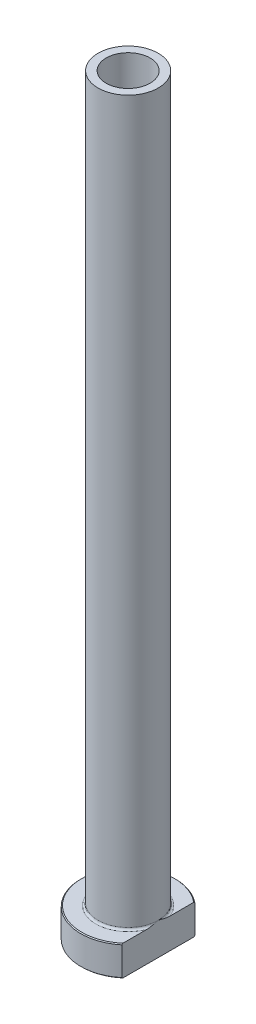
ISO-10303-21;
HEADER;
FILE_DESCRIPTION(('STEP AP214'),'2;1');
FILE_NAME('part.step','',(''),(''),'','','');
FILE_SCHEMA(('AUTOMOTIVE_DESIGN { 1 0 10303 214 1 1 1 1 }'));
ENDSEC;
DATA;
#1=APPLICATION_CONTEXT('core data for automotive mechanical design processes');
#2=APPLICATION_PROTOCOL_DEFINITION('international standard','automotive_design',2000,#1);
#3=PRODUCT_CONTEXT('',#1,'mechanical');
#4=PRODUCT('Part','Part','',(#3));
#5=PRODUCT_RELATED_PRODUCT_CATEGORY('part','',(#4));
#6=PRODUCT_DEFINITION_FORMATION('','',#4);
#7=PRODUCT_DEFINITION_CONTEXT('part definition',#1,'design');
#8=PRODUCT_DEFINITION('design','',#6,#7);
#9=PRODUCT_DEFINITION_SHAPE('','',#8);
#10=(LENGTH_UNIT() NAMED_UNIT(*) SI_UNIT(.MILLI.,.METRE.));
#11=(NAMED_UNIT(*) PLANE_ANGLE_UNIT() SI_UNIT($,.RADIAN.));
#12=(NAMED_UNIT(*) SI_UNIT($,.STERADIAN.) SOLID_ANGLE_UNIT());
#13=UNCERTAINTY_MEASURE_WITH_UNIT(LENGTH_MEASURE(1.E-05),#10,'distance_accuracy_value','');
#14=(GEOMETRIC_REPRESENTATION_CONTEXT(3) GLOBAL_UNCERTAINTY_ASSIGNED_CONTEXT((#13)) GLOBAL_UNIT_ASSIGNED_CONTEXT((#10,
#11,#12)) REPRESENTATION_CONTEXT('',''));
#15=CARTESIAN_POINT('',(0.,0.,0.));
#16=DIRECTION('',(0.,0.,1.));
#17=DIRECTION('',(1.,0.,0.));
#18=AXIS2_PLACEMENT_3D('',#15,#16,#17);
#19=CARTESIAN_POINT('',(0.,92.1876809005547,0.));
#20=DIRECTION('',(0.,1.,0.));
#21=DIRECTION('',(0.,0.,1.));
#22=AXIS2_PLACEMENT_3D('',#19,#20,#21);
#23=CYLINDRICAL_SURFACE('',#22,5.1);
#24=CARTESIAN_POINT('',(0.,175.,0.));
#25=DIRECTION('',(0.,1.,0.));
#26=DIRECTION('',(0.,0.,1.));
#27=AXIS2_PLACEMENT_3D('',#24,#25,#26);
#28=CIRCLE('',#27,5.1);
#29=CARTESIAN_POINT('',(0.,175.,5.1));
#30=VERTEX_POINT('',#29);
#31=EDGE_CURVE('E167',#30,#30,#28,.T.);
#32=ORIENTED_EDGE('',*,*,#31,.T.);
#33=EDGE_LOOP('',(#32));
#34=FACE_BOUND('',#33,.T.);
#35=CARTESIAN_POINT('',(0.,120.,0.));
#36=DIRECTION('',(0.,1.,0.));
#37=DIRECTION('',(0.,0.,1.));
#38=AXIS2_PLACEMENT_3D('',#35,#36,#37);
#39=CIRCLE('',#38,5.1);
#40=CARTESIAN_POINT('',(0.,120.,5.1));
#41=VERTEX_POINT('',#40);
#42=EDGE_CURVE('E170',#41,#41,#39,.T.);
#43=ORIENTED_EDGE('',*,*,#42,.F.);
#44=EDGE_LOOP('',(#43));
#45=FACE_BOUND('',#44,.T.);
#46=ADVANCED_FACE('F32',(#34,#45),#23,.F.);
#47=CARTESIAN_POINT('',(-5.1,175.,0.));
#48=DIRECTION('',(0.,1.,0.));
#49=DIRECTION('',(0.,0.,1.));
#50=AXIS2_PLACEMENT_3D('',#47,#48,#49);
#51=PLANE('',#50);
#52=CARTESIAN_POINT('',(0.,175.,0.));
#53=DIRECTION('',(0.,1.,0.));
#54=DIRECTION('',(0.,0.,1.));
#55=AXIS2_PLACEMENT_3D('',#52,#53,#54);
#56=CIRCLE('',#55,7.00000000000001);
#57=CARTESIAN_POINT('',(0.,175.,7.00000000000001));
#58=VERTEX_POINT('',#57);
#59=EDGE_CURVE('E174',#58,#58,#56,.T.);
#60=ORIENTED_EDGE('',*,*,#59,.T.);
#61=EDGE_LOOP('',(#60));
#62=FACE_BOUND('',#61,.T.);
#63=ORIENTED_EDGE('',*,*,#31,.F.);
#64=EDGE_LOOP('',(#63));
#65=FACE_BOUND('',#64,.T.);
#66=ADVANCED_FACE('F157',(#62,#65),#51,.T.);
#67=CARTESIAN_POINT('',(0.,92.1876809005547,0.));
#68=DIRECTION('',(0.,1.,0.));
#69=DIRECTION('',(0.,0.,1.));
#70=AXIS2_PLACEMENT_3D('',#67,#68,#69);
#71=CYLINDRICAL_SURFACE('',#70,7.);
#72=CARTESIAN_POINT('',(0.,7.50000000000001,0.));
#73=DIRECTION('',(0.,1.,0.));
#74=DIRECTION('',(0.,0.,1.));
#75=AXIS2_PLACEMENT_3D('',#72,#73,#74);
#76=CIRCLE('',#75,7.);
#77=CARTESIAN_POINT('',(7.,7.50000000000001,0.));
#78=VERTEX_POINT('',#77);
#79=EDGE_CURVE('E180',#78,#78,#76,.T.);
#80=ORIENTED_EDGE('',*,*,#79,.T.);
#81=EDGE_LOOP('',(#80));
#82=FACE_BOUND('',#81,.T.);
#83=ORIENTED_EDGE('',*,*,#59,.F.);
#84=EDGE_LOOP('',(#83));
#85=FACE_BOUND('',#84,.T.);
#86=ADVANCED_FACE('F162',(#82,#85),#71,.T.);
#87=CARTESIAN_POINT('',(-6.99999999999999,7.,0.));
#88=DIRECTION('',(0.,1.,0.));
#89=DIRECTION('',(0.,0.,1.));
#90=AXIS2_PLACEMENT_3D('',#87,#88,#89);
#91=PLANE('',#90);
#92=DIRECTION('',(0.,0.,1.));
#93=VECTOR('',#92,1.);
#94=CARTESIAN_POINT('',(6.99999999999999,7.,0.));
#95=LINE('',#94,#93);
#96=CARTESIAN_POINT('',(7.,7.,-8.22435407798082));
#97=VERTEX_POINT('',#96);
#98=CARTESIAN_POINT('',(6.99999999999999,7.,-2.69258240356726));
#99=VERTEX_POINT('',#98);
#100=EDGE_CURVE('E54',#97,#99,#95,.T.);
#101=ORIENTED_EDGE('',*,*,#100,.F.);
#102=CARTESIAN_POINT('',(0.,7.,0.));
#103=DIRECTION('',(0.,1.,0.));
#104=DIRECTION('',(0.,0.,1.));
#105=AXIS2_PLACEMENT_3D('',#102,#103,#104);
#106=CIRCLE('',#105,10.8);
#107=CARTESIAN_POINT('',(6.99999999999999,7.,8.22435407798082));
#108=VERTEX_POINT('',#107);
#109=EDGE_CURVE('E186',#97,#108,#106,.T.);
#110=ORIENTED_EDGE('',*,*,#109,.T.);
#111=CARTESIAN_POINT('',(6.99999999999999,7.,2.69258240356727));
#112=VERTEX_POINT('',#111);
#113=EDGE_CURVE('E134',#112,#108,#95,.T.);
#114=ORIENTED_EDGE('',*,*,#113,.F.);
#115=CARTESIAN_POINT('',(0.,7.,0.));
#116=DIRECTION('',(0.,1.,0.));
#117=DIRECTION('',(0.,0.,1.));
#118=AXIS2_PLACEMENT_3D('',#115,#116,#117);
#119=CIRCLE('',#118,7.5);
#120=EDGE_CURVE('E183',#112,#99,#119,.F.);
#121=ORIENTED_EDGE('',*,*,#120,.T.);
#122=EDGE_LOOP('',(#101,#110,#114,#121));
#123=FACE_BOUND('',#122,.T.);
#124=ADVANCED_FACE('F197',(#123),#91,.T.);
#125=CARTESIAN_POINT('',(0.,92.1876809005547,0.));
#126=DIRECTION('',(0.,1.,0.));
#127=DIRECTION('',(0.,0.,1.));
#128=AXIS2_PLACEMENT_3D('',#125,#126,#127);
#129=CYLINDRICAL_SURFACE('',#128,11.);
#130=DIRECTION('',(0.,-1.,0.));
#131=VECTOR('',#130,1.);
#132=CARTESIAN_POINT('',(6.99999999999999,175.,8.48528137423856));
#133=LINE('',#132,#131);
#134=CARTESIAN_POINT('',(6.99999999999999,6.8,8.48528137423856));
#135=VERTEX_POINT('',#134);
#136=CARTESIAN_POINT('',(6.99999999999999,0.199999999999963,8.48528137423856));
#137=VERTEX_POINT('',#136);
#138=EDGE_CURVE('E82',#135,#137,#133,.T.);
#139=ORIENTED_EDGE('',*,*,#138,.F.);
#140=CARTESIAN_POINT('',(0.,6.8,0.));
#141=DIRECTION('',(0.,1.,0.));
#142=DIRECTION('',(0.,0.,1.));
#143=AXIS2_PLACEMENT_3D('',#140,#141,#142);
#144=CIRCLE('',#143,11.);
#145=CARTESIAN_POINT('',(7.,6.8,-8.48528137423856));
#146=VERTEX_POINT('',#145);
#147=EDGE_CURVE('E95',#135,#146,#144,.F.);
#148=ORIENTED_EDGE('',*,*,#147,.T.);
#149=DIRECTION('',(0.,-1.,0.));
#150=VECTOR('',#149,1.);
#151=CARTESIAN_POINT('',(7.,175.,-8.48528137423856));
#152=LINE('',#151,#150);
#153=CARTESIAN_POINT('',(7.,0.199999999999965,-8.48528137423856));
#154=VERTEX_POINT('',#153);
#155=EDGE_CURVE('E192',#146,#154,#152,.T.);
#156=ORIENTED_EDGE('',*,*,#155,.T.);
#157=CARTESIAN_POINT('',(0.,0.199999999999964,0.));
#158=DIRECTION('',(0.,-1.,0.));
#159=DIRECTION('',(0.,0.,-1.));
#160=AXIS2_PLACEMENT_3D('',#157,#158,#159);
#161=CIRCLE('',#160,11.);
#162=EDGE_CURVE('E98',#154,#137,#161,.F.);
#163=ORIENTED_EDGE('',*,*,#162,.T.);
#164=EDGE_LOOP('',(#139,#148,#156,#163));
#165=FACE_BOUND('',#164,.T.);
#166=ADVANCED_FACE('F190',(#165),#129,.T.);
#167=CARTESIAN_POINT('',(-11.,0.,0.));
#168=DIRECTION('',(0.,-1.,0.));
#169=DIRECTION('',(0.,0.,-1.));
#170=AXIS2_PLACEMENT_3D('',#167,#168,#169);
#171=PLANE('',#170);
#172=CARTESIAN_POINT('',(0.,0.,0.));
#173=DIRECTION('',(0.,-1.,0.));
#174=DIRECTION('',(0.,0.,-1.));
#175=AXIS2_PLACEMENT_3D('',#172,#173,#174);
#176=CIRCLE('',#175,5.84999999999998);
#177=CARTESIAN_POINT('',(0.,0.,-5.84999999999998));
#178=VERTEX_POINT('',#177);
#179=EDGE_CURVE('E40',#178,#178,#176,.F.);
#180=ORIENTED_EDGE('',*,*,#179,.T.);
#181=EDGE_LOOP('',(#180));
#182=FACE_BOUND('',#181,.T.);
#183=DIRECTION('',(0.,0.,-1.));
#184=VECTOR('',#183,1.);
#185=CARTESIAN_POINT('',(6.99999999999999,0.,8.48528137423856));
#186=LINE('',#185,#184);
#187=CARTESIAN_POINT('',(6.99999999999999,0.,8.22435407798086));
#188=VERTEX_POINT('',#187);
#189=CARTESIAN_POINT('',(7.,0.,-8.22435407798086));
#190=VERTEX_POINT('',#189);
#191=EDGE_CURVE('E47',#188,#190,#186,.T.);
#192=ORIENTED_EDGE('',*,*,#191,.F.);
#193=CARTESIAN_POINT('',(0.,0.,0.));
#194=DIRECTION('',(0.,-1.,0.));
#195=DIRECTION('',(0.,0.,-1.));
#196=AXIS2_PLACEMENT_3D('',#193,#194,#195);
#197=CIRCLE('',#196,10.8);
#198=EDGE_CURVE('E92',#188,#190,#197,.T.);
#199=ORIENTED_EDGE('',*,*,#198,.T.);
#200=EDGE_LOOP('',(#192,#199));
#201=FACE_BOUND('',#200,.T.);
#202=ADVANCED_FACE('F91',(#182,#201),#171,.T.);
#203=CARTESIAN_POINT('',(0.,92.1876809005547,0.));
#204=DIRECTION('',(0.,1.,0.));
#205=DIRECTION('',(0.,0.,1.));
#206=AXIS2_PLACEMENT_3D('',#203,#204,#205);
#207=CYLINDRICAL_SURFACE('',#206,5.35);
#208=CARTESIAN_POINT('',(0.,0.499999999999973,0.));
#209=DIRECTION('',(0.,-1.,0.));
#210=DIRECTION('',(0.,0.,-1.));
#211=AXIS2_PLACEMENT_3D('',#208,#209,#210);
#212=CIRCLE('',#211,5.35);
#213=CARTESIAN_POINT('',(0.,0.499999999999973,-5.35));
#214=VERTEX_POINT('',#213);
#215=EDGE_CURVE('E11',#214,#214,#212,.T.);
#216=ORIENTED_EDGE('',*,*,#215,.T.);
#217=EDGE_LOOP('',(#216));
#218=FACE_BOUND('',#217,.T.);
#219=CARTESIAN_POINT('',(0.,108.,0.));
#220=DIRECTION('',(0.,1.,0.));
#221=DIRECTION('',(0.,0.,1.));
#222=AXIS2_PLACEMENT_3D('',#219,#220,#221);
#223=CIRCLE('',#222,5.35);
#224=CARTESIAN_POINT('',(0.,108.,5.35));
#225=VERTEX_POINT('',#224);
#226=EDGE_CURVE('E172',#225,#225,#223,.T.);
#227=ORIENTED_EDGE('',*,*,#226,.T.);
#228=EDGE_LOOP('',(#227));
#229=FACE_BOUND('',#228,.T.);
#230=ADVANCED_FACE('F215',(#218,#229),#207,.F.);
#231=CARTESIAN_POINT('',(0.,108.,0.));
#232=DIRECTION('',(0.,-1.,0.));
#233=DIRECTION('',(0.,0.,-1.));
#234=AXIS2_PLACEMENT_3D('',#231,#232,#233);
#235=CONICAL_SURFACE('',#234,5.35,0.0208303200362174);
#236=ORIENTED_EDGE('',*,*,#42,.T.);
#237=EDGE_LOOP('',(#236));
#238=FACE_BOUND('',#237,.T.);
#239=ORIENTED_EDGE('',*,*,#226,.F.);
#240=EDGE_LOOP('',(#239));
#241=FACE_BOUND('',#240,.T.);
#242=ADVANCED_FACE('F111',(#238,#241),#235,.F.);
#243=CARTESIAN_POINT('',(0.,7.50000000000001,0.));
#244=DIRECTION('',(0.,1.,0.));
#245=DIRECTION('',(0.,0.,1.));
#246=AXIS2_PLACEMENT_3D('',#243,#244,#245);
#247=TOROIDAL_SURFACE('',#246,7.5,0.5);
#248=ORIENTED_EDGE('',*,*,#120,.F.);
#249=CARTESIAN_POINT('',(7.,7.50000000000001,0.));
#250=CARTESIAN_POINT('',(7.,7.50000080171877,-1.25568479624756E-10));
#251=CARTESIAN_POINT('',(7.,7.50000160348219,2.9022028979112E-07));
#252=CARTESIAN_POINT('',(7.,7.50000310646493,1.10846445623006E-06));
#253=CARTESIAN_POINT('',(7.,7.50000379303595,1.65470117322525E-06));
#254=CARTESIAN_POINT('',(7.,7.50000521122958,2.96102760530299E-06));
#255=CARTESIAN_POINT('',(7.,7.50000592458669,3.74204187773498E-06));
#256=CARTESIAN_POINT('',(7.,7.50000721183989,5.36891885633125E-06));
#257=CARTESIAN_POINT('',(7.,7.50000778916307,6.21226355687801E-06));
#258=CARTESIAN_POINT('',(7.,7.50000990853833,9.44889721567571E-06));
#259=CARTESIAN_POINT('',(7.,7.50001133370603,1.19224915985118E-05));
#260=CARTESIAN_POINT('',(7.,7.50001370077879,1.68453050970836E-05));
#261=CARTESIAN_POINT('',(7.,7.50001467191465,1.92810864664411E-05));
#262=CARTESIAN_POINT('',(7.,7.5000187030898,2.95057529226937E-05));
#263=CARTESIAN_POINT('',(7.,7.50002167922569,3.73333827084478E-05));
#264=CARTESIAN_POINT('',(7.,7.5000261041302,5.21820419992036E-05));
#265=CARTESIAN_POINT('',(7.,7.50002771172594,5.91556020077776E-05));
#266=CARTESIAN_POINT('',(7.,7.50003935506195,0.000110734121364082));
#267=CARTESIAN_POINT('',(7.,7.50004810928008,0.000155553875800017));
#268=CARTESIAN_POINT('',(6.99999999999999,7.50008643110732,0.00033254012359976));
#269=CARTESIAN_POINT('',(6.99999999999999,7.50012307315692,0.000463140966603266));
#270=CARTESIAN_POINT('',(7.,7.50026565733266,0.000980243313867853));
#271=CARTESIAN_POINT('',(7.,7.50036696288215,0.00136762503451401));
#272=CARTESIAN_POINT('',(6.99999999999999,7.50077257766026,0.00290683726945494));
#273=CARTESIAN_POINT('',(6.99999999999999,7.5010826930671,0.00405753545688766));
#274=CARTESIAN_POINT('',(7.,7.50237341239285,0.00885983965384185));
#275=CARTESIAN_POINT('',(7.,7.50334676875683,0.0125128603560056));
#276=CARTESIAN_POINT('',(6.99999999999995,7.51627189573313,0.0610038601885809));
#277=CARTESIAN_POINT('',(6.99999999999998,7.52827280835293,0.105832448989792));
#278=CARTESIAN_POINT('',(7.00000000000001,7.551709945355,0.193693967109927));
#279=CARTESIAN_POINT('',(7.,7.56314936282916,0.236726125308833));
#280=CARTESIAN_POINT('',(6.99999999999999,7.58740418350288,0.328321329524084));
#281=CARTESIAN_POINT('',(6.99999999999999,7.60020832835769,0.376887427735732));
#282=CARTESIAN_POINT('',(7.,7.62578161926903,0.474605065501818));
#283=CARTESIAN_POINT('',(7.,7.63854879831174,0.523757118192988));
#284=CARTESIAN_POINT('',(6.99999999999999,7.66904753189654,0.642366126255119));
#285=CARTESIAN_POINT('',(7.,7.68665961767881,0.711854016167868));
#286=CARTESIAN_POINT('',(7.,7.72074501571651,0.849103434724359));
#287=CARTESIAN_POINT('',(7.,7.73723627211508,0.916860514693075));
#288=CARTESIAN_POINT('',(7.,7.79038156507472,1.1410421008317));
#289=CARTESIAN_POINT('',(7.,7.82528973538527,1.29788860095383));
#290=CARTESIAN_POINT('',(7.,7.88862298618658,1.61471917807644));
#291=CARTESIAN_POINT('',(7.,7.91697354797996,1.77471883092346));
#292=CARTESIAN_POINT('',(7.,7.95258292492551,2.02253505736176));
#293=CARTESIAN_POINT('',(7.,7.96355251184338,2.10981398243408));
#294=CARTESIAN_POINT('',(7.,7.98165287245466,2.28476193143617));
#295=CARTESIAN_POINT('',(7.,7.98878459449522,2.37243085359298));
#296=CARTESIAN_POINT('',(7.,7.99822919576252,2.54760327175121));
#297=CARTESIAN_POINT('',(7.,8.00056589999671,2.63510541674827));
#298=CARTESIAN_POINT('',(7.,7.99919996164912,2.81004074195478));
#299=CARTESIAN_POINT('',(7.,7.99550272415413,2.89747391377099));
#300=CARTESIAN_POINT('',(7.,7.98391011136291,3.02882076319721));
#301=CARTESIAN_POINT('',(7.,7.9789723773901,3.0729968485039));
#302=CARTESIAN_POINT('',(7.,7.96665453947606,3.16105400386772));
#303=CARTESIAN_POINT('',(7.,7.9592724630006,3.20493480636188));
#304=CARTESIAN_POINT('',(7.,7.94168688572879,3.29163191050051));
#305=CARTESIAN_POINT('',(7.,7.93151559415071,3.3344546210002));
#306=CARTESIAN_POINT('',(7.,7.90768392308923,3.41909658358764));
#307=CARTESIAN_POINT('',(7.,7.89402748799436,3.46091691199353));
#308=CARTESIAN_POINT('',(7.,7.86214701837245,3.54331777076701));
#309=CARTESIAN_POINT('',(7.,7.84387618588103,3.58388050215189));
#310=CARTESIAN_POINT('',(7.,7.80145892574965,3.66184445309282));
#311=CARTESIAN_POINT('',(7.,7.77733569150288,3.69925738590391));
#312=CARTESIAN_POINT('',(7.,7.73714014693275,3.74836513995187));
#313=CARTESIAN_POINT('',(7.,7.72423208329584,3.76263695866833));
#314=CARTESIAN_POINT('',(7.,7.69673765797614,3.78951670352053));
#315=CARTESIAN_POINT('',(7.,7.68215013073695,3.80212346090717));
#316=CARTESIAN_POINT('',(7.,7.65099843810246,3.82514624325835));
#317=CARTESIAN_POINT('',(7.,7.63441049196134,3.83553078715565));
#318=CARTESIAN_POINT('',(7.,7.59955798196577,3.8529401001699));
#319=CARTESIAN_POINT('',(7.,7.58129885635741,3.85997533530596));
#320=CARTESIAN_POINT('',(7.,7.54906837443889,3.86837810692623));
#321=CARTESIAN_POINT('',(7.,7.53536870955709,3.87079233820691));
#322=CARTESIAN_POINT('',(7.,7.50775756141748,3.87325240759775));
#323=CARTESIAN_POINT('',(7.,7.4938461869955,3.87329942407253));
#324=CARTESIAN_POINT('',(7.,7.46623771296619,3.87102093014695));
#325=CARTESIAN_POINT('',(7.,7.45254041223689,3.8686978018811));
#326=CARTESIAN_POINT('',(7.,7.42569741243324,3.86188775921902));
#327=CARTESIAN_POINT('',(7.,7.41255212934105,3.85739924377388));
#328=CARTESIAN_POINT('',(7.,7.3825931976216,3.84468786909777));
#329=CARTESIAN_POINT('',(7.,7.36610215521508,3.83570823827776));
#330=CARTESIAN_POINT('',(7.,7.33476729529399,3.81523202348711));
#331=CARTESIAN_POINT('',(7.,7.31992737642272,3.80372966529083));
#332=CARTESIAN_POINT('',(7.,7.28371925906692,3.77170797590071));
#333=CARTESIAN_POINT('',(7.,7.26356272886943,3.74983059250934));
#334=CARTESIAN_POINT('',(7.,7.22671696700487,3.70338283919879));
#335=CARTESIAN_POINT('',(7.,7.2100336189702,3.67880800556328));
#336=CARTESIAN_POINT('',(7.,7.18026553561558,3.62921731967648));
#337=CARTESIAN_POINT('',(7.,7.16704475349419,3.60428175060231));
#338=CARTESIAN_POINT('',(7.,7.14275069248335,3.55337478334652));
#339=CARTESIAN_POINT('',(7.,7.1316794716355,3.52740242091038));
#340=CARTESIAN_POINT('',(7.,7.10104499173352,3.44809573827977));
#341=CARTESIAN_POINT('',(7.,7.08424174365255,3.39369851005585));
#342=CARTESIAN_POINT('',(7.,7.05431378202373,3.27667221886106));
#343=CARTESIAN_POINT('',(7.,7.04191718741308,3.21386807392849));
#344=CARTESIAN_POINT('',(7.,7.02234605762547,3.08735184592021));
#345=CARTESIAN_POINT('',(7.,7.01518234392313,3.0236381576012));
#346=CARTESIAN_POINT('',(7.,7.00517826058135,2.8977900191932));
#347=CARTESIAN_POINT('',(7.,7.00221627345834,2.8356646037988));
#348=CARTESIAN_POINT('',(7.,6.99952325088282,2.71160626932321));
#349=CARTESIAN_POINT('',(7.,6.99977918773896,2.64967358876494));
#350=CARTESIAN_POINT('',(7.,7.00377761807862,2.49407814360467));
#351=CARTESIAN_POINT('',(7.,7.00924384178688,2.40046113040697));
#352=CARTESIAN_POINT('',(7.,7.02494106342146,2.21367396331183));
#353=CARTESIAN_POINT('',(7.,7.0351710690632,2.12050372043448));
#354=CARTESIAN_POINT('',(7.,7.05969765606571,1.93249035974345));
#355=CARTESIAN_POINT('',(7.,7.07408383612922,1.83765914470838));
#356=CARTESIAN_POINT('',(7.,7.1060330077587,1.6482934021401));
#357=CARTESIAN_POINT('',(7.,7.12360402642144,1.55376025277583));
#358=CARTESIAN_POINT('',(7.,7.16806468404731,1.33086107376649));
#359=CARTESIAN_POINT('',(7.,7.19601783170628,1.20270896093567));
#360=CARTESIAN_POINT('',(7.,7.25475947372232,0.948586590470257));
#361=CARTESIAN_POINT('',(7.,7.28551257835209,0.822607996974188));
#362=CARTESIAN_POINT('',(7.,7.33123897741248,0.64133402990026));
#363=CARTESIAN_POINT('',(7.,7.34543722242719,0.585840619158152));
#364=CARTESIAN_POINT('',(6.99999999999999,7.37418243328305,0.474686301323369));
#365=CARTESIAN_POINT('',(6.99999999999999,7.38873064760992,0.419025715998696));
#366=CARTESIAN_POINT('',(7.,7.41873357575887,0.305011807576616));
#367=CARTESIAN_POINT('',(7.,7.43419762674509,0.246660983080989));
#368=CARTESIAN_POINT('',(6.99999999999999,7.46502361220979,0.130933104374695));
#369=CARTESIAN_POINT('',(6.99999999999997,7.48038319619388,0.073555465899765));
#370=CARTESIAN_POINT('',(7.,7.49665455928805,0.0125077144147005));
#371=CARTESIAN_POINT('',(7.,7.49762931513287,0.00884956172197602));
#372=CARTESIAN_POINT('',(6.99999999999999,7.49892036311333,0.00404608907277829));
#373=CARTESIAN_POINT('',(6.99999999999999,7.49922940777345,0.00289935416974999));
#374=CARTESIAN_POINT('',(7.,7.49963371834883,0.00136508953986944));
#375=CARTESIAN_POINT('',(7.,7.49973476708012,0.000978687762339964));
#376=CARTESIAN_POINT('',(6.99999999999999,7.49987704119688,0.00046273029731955));
#377=CARTESIAN_POINT('',(6.99999999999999,7.4999136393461,0.000332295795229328));
#378=CARTESIAN_POINT('',(7.,7.49995192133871,0.000155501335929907));
#379=CARTESIAN_POINT('',(7.,7.49996067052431,0.000110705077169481));
#380=CARTESIAN_POINT('',(7.,7.49997230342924,5.91504871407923E-05));
#381=CARTESIAN_POINT('',(7.,7.49997390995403,5.21782476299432E-05));
#382=CARTESIAN_POINT('',(7.,7.49997833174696,3.73322821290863E-05));
#383=CARTESIAN_POINT('',(7.,7.49998130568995,2.95059555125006E-05));
#384=CARTESIAN_POINT('',(7.,7.49998533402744,1.92826357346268E-05));
#385=CARTESIAN_POINT('',(7.,7.49998630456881,1.68469531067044E-05));
#386=CARTESIAN_POINT('',(7.,7.49998867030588,1.19242379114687E-05));
#387=CARTESIAN_POINT('',(7.,7.49999009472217,9.45063101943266E-06));
#388=CARTESIAN_POINT('',(7.,7.49999221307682,6.21386478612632E-06));
#389=CARTESIAN_POINT('',(7.,7.4999927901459,5.37045339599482E-06));
#390=CARTESIAN_POINT('',(7.,7.49999407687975,3.74339717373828E-06));
#391=CARTESIAN_POINT('',(7.,7.49999478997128,2.96226879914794E-06));
#392=CARTESIAN_POINT('',(7.,7.49999620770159,1.65567359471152E-06));
#393=CARTESIAN_POINT('',(7.,7.49999689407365,1.10929204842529E-06));
#394=CARTESIAN_POINT('',(7.,7.49999839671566,2.90683225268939E-07));
#395=CARTESIAN_POINT('',(7.,7.49999919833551,1.25561410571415E-10));
#396=CARTESIAN_POINT('',(7.,7.50000000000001,0.));
#397=B_SPLINE_CURVE_WITH_KNOTS('',3,(#249,#250,#251,#252,#253,#254,#255,#256,#257,#258,#259,
#260,#261,#262,#263,#264,#265,#266,#267,#268,#269,#270,#271,#272,#273,#274,#275,#276,#277,#278,
#279,#280,#281,#282,#283,#284,#285,#286,#287,#288,#289,#290,#291,#292,#293,#294,#295,#296,#297,
#298,#299,#300,#301,#302,#303,#304,#305,#306,#307,#308,#309,#310,#311,#312,#313,#314,#315,#316,
#317,#318,#319,#320,#321,#322,#323,#324,#325,#326,#327,#328,#329,#330,#331,#332,#333,#334,#335,
#336,#337,#338,#339,#340,#341,#342,#343,#344,#345,#346,#347,#348,#349,#350,#351,#352,#353,#354,
#355,#356,#357,#358,#359,#360,#361,#362,#363,#364,#365,#366,#367,#368,#369,#370,#371,#372,#373,
#374,#375,#376,#377,#378,#379,#380,#381,#382,#383,#384,#385,#386,#387,#388,#389,#390,#391,#392,
#393,#394,#395,#396),.UNSPECIFIED.,.T.,.F.,(4,2,2,2,2,2,2,2,2,2,2,2,2,2,2,2,2,2,2,2,2,2,2,2,2,2,
2,2,2,2,2,2,2,2,2,2,2,2,2,2,2,2,2,2,2,2,2,2,2,2,2,2,2,2,2,2,2,2,2,2,2,2,2,2,2,2,2,2,2,2,2,2,2,
4),(0.,2.42201381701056E-06,5.0530479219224E-06,8.20814016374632E-06,1.12722920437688E-05,
1.98044004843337E-05,2.76642048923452E-05,5.27403832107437E-05,7.41830767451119E-05,
0.000211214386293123,0.000617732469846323,0.00181938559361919,0.00539412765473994,
0.016736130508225,0.155952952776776,0.2895341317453,0.440210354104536,0.592559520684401,
0.807611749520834,1.0168149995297,1.49878389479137,1.98598665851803,2.24981935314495,
2.5135868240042,2.77604050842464,3.03825922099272,3.17156039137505,3.3049693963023,
3.43689837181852,3.5686786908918,3.70185328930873,3.83450849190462,3.89212877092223,
3.94978928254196,4.00821928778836,4.06646549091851,4.10801107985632,4.14953598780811,
4.19101920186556,4.23253313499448,4.28854866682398,4.34469377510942,4.4334341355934,
4.52232362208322,4.60686785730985,4.69149264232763,4.86185145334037,5.05362927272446,
5.24580256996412,5.43229132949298,5.61802533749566,5.89918385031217,6.18028382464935,
6.46796485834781,6.75638131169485,7.14981284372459,7.53882346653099,7.71066604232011,
7.88325629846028,8.0643532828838,8.24254095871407,8.25389891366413,8.25746134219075,
8.25865995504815,8.25906595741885,8.25920291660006,8.25922435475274,8.25924942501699,
8.25925728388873,8.25926581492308,8.25926887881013,8.25927203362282,8.25927466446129,
8.25927708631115),.UNSPECIFIED.);
#398=EDGE_CURVE('E126',#112,#78,#397,.T.);
#399=ORIENTED_EDGE('',*,*,#398,.T.);
#400=ORIENTED_EDGE('',*,*,#79,.F.);
#401=CARTESIAN_POINT('',(7.,7.50000000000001,0.));
#402=CARTESIAN_POINT('',(7.,7.49999919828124,1.25569885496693E-10));
#403=CARTESIAN_POINT('',(7.,7.49999839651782,-2.90220288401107E-07));
#404=CARTESIAN_POINT('',(7.,7.49999689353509,-1.10846445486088E-06));
#405=CARTESIAN_POINT('',(7.,7.49999620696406,-1.65470117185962E-06));
#406=CARTESIAN_POINT('',(7.,7.49999478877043,-2.96102760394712E-06));
#407=CARTESIAN_POINT('',(7.,7.49999407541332,-3.7420418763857E-06));
#408=CARTESIAN_POINT('',(7.,7.49999278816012,-5.36891885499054E-06));
#409=CARTESIAN_POINT('',(7.,7.49999221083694,-6.2122635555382E-06));
#410=CARTESIAN_POINT('',(7.,7.49999009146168,-9.44889721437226E-06));
#411=CARTESIAN_POINT('',(7.,7.49998866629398,-1.19224915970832E-05));
#412=CARTESIAN_POINT('',(7.,7.49998629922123,-1.68453050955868E-05));
#413=CARTESIAN_POINT('',(7.,7.49998532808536,-1.92810864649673E-05));
#414=CARTESIAN_POINT('',(7.,7.49998129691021,-2.950575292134E-05));
#415=CARTESIAN_POINT('',(7.,7.49997832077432,-3.73333827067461E-05));
#416=CARTESIAN_POINT('',(7.,7.49997389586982,-5.21820419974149E-05));
#417=CARTESIAN_POINT('',(7.,7.49997228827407,-5.91556020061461E-05));
#418=CARTESIAN_POINT('',(7.,7.49996064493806,-0.000110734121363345));
#419=CARTESIAN_POINT('',(7.,7.49995189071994,-0.000155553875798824));
#420=CARTESIAN_POINT('',(6.99999999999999,7.49991356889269,-0.000332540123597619));
#421=CARTESIAN_POINT('',(6.99999999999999,7.49987692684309,-0.00046314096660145));
#422=CARTESIAN_POINT('',(7.,7.49973434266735,-0.000980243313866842));
#423=CARTESIAN_POINT('',(7.,7.49963303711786,-0.00136762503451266));
#424=CARTESIAN_POINT('',(6.99999999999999,7.49922742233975,-0.0029068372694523));
#425=CARTESIAN_POINT('',(6.99999999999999,7.49891730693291,-0.00405753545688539));
#426=CARTESIAN_POINT('',(7.,7.49762658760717,-0.00885983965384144));
#427=CARTESIAN_POINT('',(7.,7.49665323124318,-0.0125128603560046));
#428=CARTESIAN_POINT('',(6.99999999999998,7.48372810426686,-0.0610038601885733));
#429=CARTESIAN_POINT('',(6.99999999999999,7.47172719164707,-0.105832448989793));
#430=CARTESIAN_POINT('',(7.,7.44829005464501,-0.193693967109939));
#431=CARTESIAN_POINT('',(7.,7.43685063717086,-0.236726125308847));
#432=CARTESIAN_POINT('',(6.99999999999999,7.41259581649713,-0.328321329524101));
#433=CARTESIAN_POINT('',(7.,7.39979167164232,-0.376887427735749));
#434=CARTESIAN_POINT('',(7.,7.37421838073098,-0.474605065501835));
#435=CARTESIAN_POINT('',(7.,7.36145120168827,-0.523757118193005));
#436=CARTESIAN_POINT('',(7.,7.33095246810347,-0.642366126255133));
#437=CARTESIAN_POINT('',(7.,7.3133403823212,-0.711854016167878));
#438=CARTESIAN_POINT('',(7.,7.2792549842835,-0.849103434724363));
#439=CARTESIAN_POINT('',(7.,7.26276372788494,-0.916860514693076));
#440=CARTESIAN_POINT('',(7.,7.20961843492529,-1.1410421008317));
#441=CARTESIAN_POINT('',(7.,7.17471026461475,-1.29788860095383));
#442=CARTESIAN_POINT('',(7.,7.11137701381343,-1.61471917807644));
#443=CARTESIAN_POINT('',(7.,7.08302645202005,-1.77471883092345));
#444=CARTESIAN_POINT('',(7.,7.0474170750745,-2.02253505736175));
#445=CARTESIAN_POINT('',(7.,7.03644748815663,-2.10981398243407));
#446=CARTESIAN_POINT('',(7.,7.01834712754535,-2.28476193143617));
#447=CARTESIAN_POINT('',(7.,7.01121540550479,-2.37243085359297));
#448=CARTESIAN_POINT('',(7.,7.00177080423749,-2.5476032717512));
#449=CARTESIAN_POINT('',(7.,6.9994341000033,-2.63510541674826));
#450=CARTESIAN_POINT('',(7.,7.00080003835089,-2.81004074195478));
#451=CARTESIAN_POINT('',(7.,7.00449727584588,-2.89747391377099));
#452=CARTESIAN_POINT('',(7.,7.01608988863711,-3.02882076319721));
#453=CARTESIAN_POINT('',(7.,7.02102762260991,-3.0729968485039));
#454=CARTESIAN_POINT('',(7.,7.03334546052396,-3.16105400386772));
#455=CARTESIAN_POINT('',(7.,7.04072753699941,-3.20493480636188));
#456=CARTESIAN_POINT('',(7.,7.05831311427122,-3.29163191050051));
#457=CARTESIAN_POINT('',(7.,7.06848440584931,-3.3344546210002));
#458=CARTESIAN_POINT('',(7.,7.09231607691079,-3.41909658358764));
#459=CARTESIAN_POINT('',(7.,7.10597251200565,-3.46091691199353));
#460=CARTESIAN_POINT('',(7.,7.13785298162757,-3.54331777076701));
#461=CARTESIAN_POINT('',(7.,7.15612381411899,-3.58388050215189));
#462=CARTESIAN_POINT('',(7.,7.19854107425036,-3.66184445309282));
#463=CARTESIAN_POINT('',(7.,7.22266430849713,-3.69925738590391));
#464=CARTESIAN_POINT('',(7.,7.26285985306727,-3.74836513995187));
#465=CARTESIAN_POINT('',(7.,7.27576791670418,-3.76263695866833));
#466=CARTESIAN_POINT('',(7.,7.30326234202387,-3.78951670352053));
#467=CARTESIAN_POINT('',(7.,7.31784986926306,-3.80212346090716));
#468=CARTESIAN_POINT('',(7.,7.34900156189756,-3.82514624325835));
#469=CARTESIAN_POINT('',(7.,7.36558950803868,-3.83553078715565));
#470=CARTESIAN_POINT('',(7.,7.40044201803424,-3.8529401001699));
#471=CARTESIAN_POINT('',(7.,7.4187011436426,-3.85997533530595));
#472=CARTESIAN_POINT('',(7.,7.45093162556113,-3.86837810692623));
#473=CARTESIAN_POINT('',(7.,7.46463129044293,-3.87079233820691));
#474=CARTESIAN_POINT('',(7.,7.49224243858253,-3.87325240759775));
#475=CARTESIAN_POINT('',(7.,7.50615381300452,-3.87329942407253));
#476=CARTESIAN_POINT('',(7.,7.53376228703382,-3.87102093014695));
#477=CARTESIAN_POINT('',(7.,7.54745958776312,-3.8686978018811));
#478=CARTESIAN_POINT('',(7.,7.57430258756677,-3.86188775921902));
#479=CARTESIAN_POINT('',(7.,7.58744787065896,-3.85739924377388));
#480=CARTESIAN_POINT('',(7.,7.61740680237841,-3.84468786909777));
#481=CARTESIAN_POINT('',(7.,7.63389784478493,-3.83570823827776));
#482=CARTESIAN_POINT('',(7.,7.66523270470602,-3.81523202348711));
#483=CARTESIAN_POINT('',(7.,7.68007262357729,-3.80372966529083));
#484=CARTESIAN_POINT('',(7.,7.71628074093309,-3.77170797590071));
#485=CARTESIAN_POINT('',(7.,7.73643727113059,-3.74983059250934));
#486=CARTESIAN_POINT('',(7.,7.77328303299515,-3.70338283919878));
#487=CARTESIAN_POINT('',(7.,7.78996638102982,-3.67880800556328));
#488=CARTESIAN_POINT('',(7.,7.81973446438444,-3.62921731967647));
#489=CARTESIAN_POINT('',(7.,7.83295524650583,-3.6042817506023));
#490=CARTESIAN_POINT('',(7.,7.85724930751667,-3.55337478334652));
#491=CARTESIAN_POINT('',(7.,7.86832052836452,-3.52740242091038));
#492=CARTESIAN_POINT('',(7.,7.89895500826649,-3.44809573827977));
#493=CARTESIAN_POINT('',(7.,7.91575825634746,-3.39369851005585));
#494=CARTESIAN_POINT('',(7.,7.94568621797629,-3.27667221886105));
#495=CARTESIAN_POINT('',(7.,7.95808281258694,-3.21386807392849));
#496=CARTESIAN_POINT('',(7.,7.97765394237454,-3.0873518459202));
#497=CARTESIAN_POINT('',(7.,7.98481765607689,-3.02363815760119));
#498=CARTESIAN_POINT('',(7.,7.99482173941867,-2.89779001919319));
#499=CARTESIAN_POINT('',(7.,7.99778372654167,-2.83566460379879));
#500=CARTESIAN_POINT('',(7.,8.0004767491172,-2.71160626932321));
#501=CARTESIAN_POINT('',(7.,8.00022081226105,-2.64967358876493));
#502=CARTESIAN_POINT('',(7.,7.99622238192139,-2.49407814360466));
#503=CARTESIAN_POINT('',(7.,7.99075615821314,-2.40046113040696));
#504=CARTESIAN_POINT('',(7.,7.97505893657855,-2.21367396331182));
#505=CARTESIAN_POINT('',(7.,7.96482893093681,-2.12050372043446));
#506=CARTESIAN_POINT('',(7.,7.9403023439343,-1.93249035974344));
#507=CARTESIAN_POINT('',(7.,7.92591616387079,-1.83765914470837));
#508=CARTESIAN_POINT('',(7.,7.89396699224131,-1.64829340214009));
#509=CARTESIAN_POINT('',(7.,7.87639597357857,-1.55376025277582));
#510=CARTESIAN_POINT('',(7.,7.8319353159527,-1.33086107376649));
#511=CARTESIAN_POINT('',(7.,7.80398216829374,-1.20270896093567));
#512=CARTESIAN_POINT('',(7.,7.7452405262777,-0.948586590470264));
#513=CARTESIAN_POINT('',(7.,7.71448742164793,-0.822607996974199));
#514=CARTESIAN_POINT('',(7.,7.66876102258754,-0.641334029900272));
#515=CARTESIAN_POINT('',(7.,7.65456277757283,-0.585840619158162));
#516=CARTESIAN_POINT('',(6.99999999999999,7.62581756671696,-0.474686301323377));
#517=CARTESIAN_POINT('',(6.99999999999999,7.61126935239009,-0.419025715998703));
#518=CARTESIAN_POINT('',(7.,7.58126642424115,-0.305011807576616));
#519=CARTESIAN_POINT('',(7.,7.56580237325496,-0.246660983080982));
#520=CARTESIAN_POINT('',(6.99999999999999,7.53497638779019,-0.130933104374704));
#521=CARTESIAN_POINT('',(6.99999999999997,7.519616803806,-0.0735554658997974));
#522=CARTESIAN_POINT('',(7.,7.50334544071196,-0.0125077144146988));
#523=CARTESIAN_POINT('',(7.,7.50237068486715,-0.00884956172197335));
#524=CARTESIAN_POINT('',(6.99999999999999,7.50107963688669,-0.00404608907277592));
#525=CARTESIAN_POINT('',(6.99999999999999,7.50077059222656,-0.00289935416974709));
#526=CARTESIAN_POINT('',(7.,7.50036628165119,-0.00136508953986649));
#527=CARTESIAN_POINT('',(7.,7.50026523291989,-0.000978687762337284));
#528=CARTESIAN_POINT('',(6.99999999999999,7.50012295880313,-0.000462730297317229));
#529=CARTESIAN_POINT('',(6.99999999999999,7.50008636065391,-0.000332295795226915));
#530=CARTESIAN_POINT('',(7.,7.50004807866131,-0.000155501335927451));
#531=CARTESIAN_POINT('',(7.,7.50003932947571,-0.000110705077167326));
#532=CARTESIAN_POINT('',(7.,7.50002769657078,-5.91504871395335E-05));
#533=CARTESIAN_POINT('',(7.,7.50002609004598,-5.21782476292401E-05));
#534=CARTESIAN_POINT('',(7.,7.50002166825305,-3.73322821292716E-05));
#535=CARTESIAN_POINT('',(7.,7.50001869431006,-2.95059555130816E-05));
#536=CARTESIAN_POINT('',(7.,7.50001466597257,-1.9282635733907E-05));
#537=CARTESIAN_POINT('',(7.,7.5000136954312,-1.68469531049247E-05));
#538=CARTESIAN_POINT('',(7.,7.50001132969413,-1.19242379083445E-05));
#539=CARTESIAN_POINT('',(7.,7.50000990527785,-9.45063101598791E-06));
#540=CARTESIAN_POINT('',(7.,7.50000778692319,-6.21386478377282E-06));
#541=CARTESIAN_POINT('',(7.,7.50000720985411,-5.3704533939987E-06));
#542=CARTESIAN_POINT('',(7.,7.50000592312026,-3.74339717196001E-06));
#543=CARTESIAN_POINT('',(7.,7.50000521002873,-2.96226879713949E-06));
#544=CARTESIAN_POINT('',(7.,7.50000379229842,-1.65567359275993E-06));
#545=CARTESIAN_POINT('',(7.,7.50000310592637,-1.10929204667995E-06));
#546=CARTESIAN_POINT('',(7.,7.50000160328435,-2.9068322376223E-07));
#547=CARTESIAN_POINT('',(7.,7.5000008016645,-1.25559954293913E-10));
#548=CARTESIAN_POINT('',(7.,7.50000000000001,0.));
#549=B_SPLINE_CURVE_WITH_KNOTS('',3,(#401,#402,#403,#404,#405,#406,#407,#408,#409,#410,#411,
#412,#413,#414,#415,#416,#417,#418,#419,#420,#421,#422,#423,#424,#425,#426,#427,#428,#429,#430,
#431,#432,#433,#434,#435,#436,#437,#438,#439,#440,#441,#442,#443,#444,#445,#446,#447,#448,#449,
#450,#451,#452,#453,#454,#455,#456,#457,#458,#459,#460,#461,#462,#463,#464,#465,#466,#467,#468,
#469,#470,#471,#472,#473,#474,#475,#476,#477,#478,#479,#480,#481,#482,#483,#484,#485,#486,#487,
#488,#489,#490,#491,#492,#493,#494,#495,#496,#497,#498,#499,#500,#501,#502,#503,#504,#505,#506,
#507,#508,#509,#510,#511,#512,#513,#514,#515,#516,#517,#518,#519,#520,#521,#522,#523,#524,#525,
#526,#527,#528,#529,#530,#531,#532,#533,#534,#535,#536,#537,#538,#539,#540,#541,#542,#543,#544,
#545,#546,#547,#548),.UNSPECIFIED.,.T.,.F.,(4,2,2,2,2,2,2,2,2,2,2,2,2,2,2,2,2,2,2,2,2,2,2,2,2,2,
2,2,2,2,2,2,2,2,2,2,2,2,2,2,2,2,2,2,2,2,2,2,2,2,2,2,2,2,2,2,2,2,2,2,2,2,2,2,2,2,2,2,2,2,2,2,2,
4),(0.,2.42201381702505E-06,5.05304792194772E-06,8.20814016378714E-06,1.12722920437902E-05,
1.98044004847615E-05,2.7664204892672E-05,5.27403832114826E-05,7.41830767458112E-05,
0.000211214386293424,0.000617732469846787,0.00181938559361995,0.00539412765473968,
0.0167361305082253,0.155952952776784,0.289534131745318,0.440210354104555,0.592559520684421,
0.807611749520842,1.0168149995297,1.49878389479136,1.98598665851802,2.24981935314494,
2.5135868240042,2.77604050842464,3.03825922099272,3.17156039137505,3.3049693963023,
3.43689837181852,3.5686786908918,3.70185328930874,3.83450849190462,3.89212877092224,
3.94978928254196,4.00821928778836,4.06646549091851,4.10801107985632,4.14953598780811,
4.19101920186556,4.23253313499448,4.28854866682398,4.34469377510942,4.4334341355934,
4.52232362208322,4.60686785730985,4.69149264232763,4.86185145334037,5.05362927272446,
5.24580256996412,5.43229132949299,5.61802533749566,5.89918385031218,6.18028382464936,
6.46796485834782,6.75638131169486,7.14981284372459,7.53882346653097,7.7106660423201,
7.88325629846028,8.0643532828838,8.24254095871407,8.25389891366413,8.25746134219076,
8.25865995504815,8.25906595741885,8.25920291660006,8.25922435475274,8.25924942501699,
8.25925728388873,8.25926581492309,8.25926887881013,8.25927203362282,8.25927466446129,
8.25927708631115),.UNSPECIFIED.);
#550=EDGE_CURVE('E135',#78,#99,#549,.T.);
#551=ORIENTED_EDGE('',*,*,#550,.T.);
#552=EDGE_LOOP('',(#248,#399,#400,#551));
#553=FACE_BOUND('',#552,.T.);
#554=ADVANCED_FACE('F141',(#553),#247,.F.);
#555=CARTESIAN_POINT('',(0.,7.00000000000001,0.));
#556=DIRECTION('',(0.,-1.,0.));
#557=DIRECTION('',(0.,0.,-1.));
#558=AXIS2_PLACEMENT_3D('',#555,#556,#557);
#559=CONICAL_SURFACE('',#558,10.8,0.785398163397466);
#560=CARTESIAN_POINT('',(7.,-2.13774979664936,-18.6685261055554));
#561=CARTESIAN_POINT('',(7.,-1.86574872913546,-18.3780244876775));
#562=CARTESIAN_POINT('',(7.,-1.59415659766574,-18.0871392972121));
#563=CARTESIAN_POINT('',(7.,-1.05192877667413,-17.5044755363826));
#564=CARTESIAN_POINT('',(7.,-0.781293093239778,-17.2126969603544));
#565=CARTESIAN_POINT('',(7.,-0.241050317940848,-16.6280482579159));
#566=CARTESIAN_POINT('',(7.,0.02855648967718,-16.3351778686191));
#567=CARTESIAN_POINT('',(7.,0.566485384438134,-15.7482616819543));
#568=CARTESIAN_POINT('',(7.,0.834807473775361,-15.4542158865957));
#569=CARTESIAN_POINT('',(7.,1.64198377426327,-14.5651645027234));
#570=CARTESIAN_POINT('',(7.,2.17856420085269,-13.9680841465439));
#571=CARTESIAN_POINT('',(7.,2.97696333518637,-13.0668144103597));
#572=CARTESIAN_POINT('',(7.,3.24199785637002,-12.7654727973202));
#573=CARTESIAN_POINT('',(7.,3.76945856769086,-12.1605141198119));
#574=CARTESIAN_POINT('',(7.,4.0318847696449,-11.8568970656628));
#575=CARTESIAN_POINT('',(7.,4.50733797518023,-11.3009625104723));
#576=CARTESIAN_POINT('',(7.,4.72088020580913,-11.0490858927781));
#577=CARTESIAN_POINT('',(7.,5.14538078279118,-10.543165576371));
#578=CARTESIAN_POINT('',(7.,5.35633915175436,-10.2891218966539));
#579=CARTESIAN_POINT('',(7.,5.77522964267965,-9.77836737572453));
#580=CARTESIAN_POINT('',(7.,5.98316044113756,-9.52165544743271));
#581=CARTESIAN_POINT('',(7.,6.39521098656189,-9.00519084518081));
#582=CARTESIAN_POINT('',(7.,6.59933078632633,-8.74543821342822));
#583=CARTESIAN_POINT('',(7.,7.00243445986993,-8.22283607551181));
#584=CARTESIAN_POINT('',(7.,7.20142819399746,-7.95999419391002));
#585=CARTESIAN_POINT('',(7.,7.59353840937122,-7.42991856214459));
#586=CARTESIAN_POINT('',(7.,7.78665447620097,-7.16268450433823));
#587=CARTESIAN_POINT('',(7.,8.16523718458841,-6.62311113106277));
#588=CARTESIAN_POINT('',(7.,8.35070911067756,-6.35077553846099));
#589=CARTESIAN_POINT('',(7.,8.71189725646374,-5.79973731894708));
#590=CARTESIAN_POINT('',(7.,8.88761537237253,-5.5210359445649));
#591=CARTESIAN_POINT('',(7.,9.19554959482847,-5.00707921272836));
#592=CARTESIAN_POINT('',(7.,9.3298807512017,-4.77309669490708));
#593=CARTESIAN_POINT('',(7.,9.5876425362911,-4.29911523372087));
#594=CARTESIAN_POINT('',(7.,9.71107181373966,-4.05911554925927));
#595=CARTESIAN_POINT('',(7.,9.94390907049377,-3.57263619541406));
#596=CARTESIAN_POINT('',(7.,10.0533307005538,-3.32616312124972));
#597=CARTESIAN_POINT('',(7.,10.2545146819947,-2.82607166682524));
#598=CARTESIAN_POINT('',(7.,10.3462820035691,-2.57245532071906));
#599=CARTESIAN_POINT('',(7.,10.4907049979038,-2.11254447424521));
#600=CARTESIAN_POINT('',(7.,10.5475277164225,-1.90756611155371));
#601=CARTESIAN_POINT('',(7.,10.6452043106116,-1.49381161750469));
#602=CARTESIAN_POINT('',(7.,10.68606033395,-1.28503600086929));
#603=CARTESIAN_POINT('',(7.,10.7497550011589,-0.865342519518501));
#604=CARTESIAN_POINT('',(7.,10.7726462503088,-0.654432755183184));
#605=CARTESIAN_POINT('',(7.,10.7993569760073,-0.231396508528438));
#606=CARTESIAN_POINT('',(7.,10.8031771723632,-0.0192700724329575));
#607=CARTESIAN_POINT('',(7.,10.7915178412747,0.404715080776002));
#608=CARTESIAN_POINT('',(7.,10.7760135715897,0.61657310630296));
#609=CARTESIAN_POINT('',(7.,10.7265413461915,1.03810446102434));
#610=CARTESIAN_POINT('',(7.,10.6925718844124,1.24777761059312));
#611=CARTESIAN_POINT('',(7.,10.6077703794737,1.66430273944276));
#612=CARTESIAN_POINT('',(7.,10.5568873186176,1.87114418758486));
#613=CARTESIAN_POINT('',(7.,10.4404729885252,2.28061279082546));
#614=CARTESIAN_POINT('',(7.,10.3749414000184,2.48323985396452));
#615=CARTESIAN_POINT('',(7.,10.2190980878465,2.91860265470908));
#616=CARTESIAN_POINT('',(7.,10.1264616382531,3.15050038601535));
#617=CARTESIAN_POINT('',(7.,9.92740958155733,3.60835455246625));
#618=CARTESIAN_POINT('',(7.,9.82098769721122,3.83430822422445));
#619=CARTESIAN_POINT('',(7.,9.59695142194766,4.28105341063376));
#620=CARTESIAN_POINT('',(6.99999999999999,9.47931762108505,4.501835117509));
#621=CARTESIAN_POINT('',(6.99999999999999,9.23524231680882,4.93840249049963));
#622=CARTESIAN_POINT('',(6.99999999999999,9.1088020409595,5.1541888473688));
#623=CARTESIAN_POINT('',(6.99999999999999,8.84714657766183,5.58417945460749));
#624=CARTESIAN_POINT('',(6.99999999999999,8.71183920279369,5.79832734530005));
#625=CARTESIAN_POINT('',(6.99999999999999,8.43533082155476,6.22277635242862));
#626=CARTESIAN_POINT('',(6.99999999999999,8.29412966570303,6.43307737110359));
#627=CARTESIAN_POINT('',(6.99999999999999,8.00706556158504,6.85014007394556));
#628=CARTESIAN_POINT('',(6.99999999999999,7.86120763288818,7.05690522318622));
#629=CARTESIAN_POINT('',(6.99999999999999,7.56553131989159,7.4675727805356));
#630=CARTESIAN_POINT('',(6.99999999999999,7.41571298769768,7.67147522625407));
#631=CARTESIAN_POINT('',(6.99999999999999,7.07999705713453,8.12067189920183));
#632=CARTESIAN_POINT('',(6.99999999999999,6.89330819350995,8.36537403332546));
#633=CARTESIAN_POINT('',(6.99999999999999,6.51597189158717,8.85171196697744));
#634=CARTESIAN_POINT('',(6.99999999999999,6.32532432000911,9.09334766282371));
#635=CARTESIAN_POINT('',(6.99999999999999,5.94076020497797,9.57404667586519));
#636=CARTESIAN_POINT('',(6.99999999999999,5.74684327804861,9.81310968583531));
#637=CARTESIAN_POINT('',(6.99999999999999,5.35630729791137,10.2890203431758));
#638=CARTESIAN_POINT('',(6.99999999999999,5.15968820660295,10.5258679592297));
#639=CARTESIAN_POINT('',(6.99999999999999,4.56606953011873,11.2340330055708));
#640=CARTESIAN_POINT('',(6.99999999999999,4.16568148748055,11.7025100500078));
#641=CARTESIAN_POINT('',(6.99999999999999,3.35840033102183,12.633824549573));
#642=CARTESIAN_POINT('',(6.99999999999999,2.95150704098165,13.0966618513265));
#643=CARTESIAN_POINT('',(6.99999999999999,2.35017562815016,13.7734103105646));
#644=CARTESIAN_POINT('',(6.99999999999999,2.15763812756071,13.9890143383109));
#645=CARTESIAN_POINT('',(6.99999999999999,1.77161609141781,14.4193671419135));
#646=CARTESIAN_POINT('',(6.99999999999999,1.57813157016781,14.6341159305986));
#647=CARTESIAN_POINT('',(6.99999999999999,0.996412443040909,15.2772388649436));
#648=CARTESIAN_POINT('',(6.99999999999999,0.606922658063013,15.7044779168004));
#649=CARTESIAN_POINT('',(6.99999999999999,-0.173895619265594,16.5556520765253));
#650=CARTESIAN_POINT('',(6.99999999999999,-0.565218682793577,16.9795921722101));
#651=CARTESIAN_POINT('',(6.99999999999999,-1.34999931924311,17.8254589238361));
#652=CARTESIAN_POINT('',(6.99999999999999,-1.74345679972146,18.2473856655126));
#653=CARTESIAN_POINT('',(6.99999999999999,-2.13774979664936,18.6685261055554));
#654=B_SPLINE_CURVE_WITH_KNOTS('',3,(#560,#561,#562,#563,#564,#565,#566,#567,#568,#569,#570,
#571,#572,#573,#574,#575,#576,#577,#578,#579,#580,#581,#582,#583,#584,#585,#586,#587,#588,#589,
#590,#591,#592,#593,#594,#595,#596,#597,#598,#599,#600,#601,#602,#603,#604,#605,#606,#607,#608,
#609,#610,#611,#612,#613,#614,#615,#616,#617,#618,#619,#620,#621,#622,#623,#624,#625,#626,#627,
#628,#629,#630,#631,#632,#633,#634,#635,#636,#637,#638,#639,#640,#641,#642,#643,#644,#645,#646,
#647,#648,#649,#650,#651,#652,#653),.UNSPECIFIED.,.F.,.F.,(4,2,2,2,2,2,2,2,2,2,2,2,2,2,2,2,2,2,
2,2,2,2,2,2,2,2,2,2,2,2,2,2,2,2,2,2,2,2,2,2,2,2,2,2,2,2,4),(0.,1.19389386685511,
2.38779531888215,3.58200567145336,4.77621398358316,7.18442154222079,8.38834194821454,
9.5922568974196,10.5828886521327,11.5735117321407,12.5645555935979,13.5555857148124,
14.5445404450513,15.5335647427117,16.5218934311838,17.5100293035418,18.3192088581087,
19.1284885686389,19.9369735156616,20.7452305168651,21.3828127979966,22.020309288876,
22.6559319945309,23.2915307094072,23.9279440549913,24.5644093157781,25.2028120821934,
25.841228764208,26.5898097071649,27.3387327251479,28.0889766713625,28.8391162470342,
29.5989369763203,30.3587769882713,31.1178239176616,31.8768608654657,32.8001653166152,
33.7235009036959,34.6469455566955,35.5704032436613,37.419100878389,39.267848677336,
40.1350269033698,41.0021920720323,42.7365692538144,44.4673795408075,46.1981154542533),.UNSPECIFIED.);
#655=EDGE_CURVE('E133',#146,#97,#654,.T.);
#656=ORIENTED_EDGE('',*,*,#655,.F.);
#657=ORIENTED_EDGE('',*,*,#147,.F.);
#658=EDGE_CURVE('E118',#108,#135,#654,.T.);
#659=ORIENTED_EDGE('',*,*,#658,.F.);
#660=ORIENTED_EDGE('',*,*,#109,.F.);
#661=EDGE_LOOP('',(#656,#657,#659,#660));
#662=FACE_BOUND('',#661,.T.);
#663=ADVANCED_FACE('F145',(#662),#559,.T.);
#664=CARTESIAN_POINT('',(0.,0.199999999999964,0.));
#665=DIRECTION('',(0.,1.,0.));
#666=DIRECTION('',(0.,0.,1.));
#667=AXIS2_PLACEMENT_3D('',#664,#665,#666);
#668=CONICAL_SURFACE('',#667,11.,0.785398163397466);
#669=CARTESIAN_POINT('',(6.99999999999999,9.13774979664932,18.6685261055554));
#670=CARTESIAN_POINT('',(6.99999999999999,8.86574872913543,18.3780244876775));
#671=CARTESIAN_POINT('',(6.99999999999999,8.5941565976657,18.0871392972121));
#672=CARTESIAN_POINT('',(6.99999999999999,8.0519287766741,17.5044755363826));
#673=CARTESIAN_POINT('',(6.99999999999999,7.78129309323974,17.2126969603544));
#674=CARTESIAN_POINT('',(6.99999999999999,7.24105031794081,16.6280482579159));
#675=CARTESIAN_POINT('',(6.99999999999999,6.97144351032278,16.3351778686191));
#676=CARTESIAN_POINT('',(6.99999999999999,6.43351461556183,15.7482616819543));
#677=CARTESIAN_POINT('',(6.99999999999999,6.1651925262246,15.4542158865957));
#678=CARTESIAN_POINT('',(6.99999999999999,5.35801622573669,14.5651645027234));
#679=CARTESIAN_POINT('',(6.99999999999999,4.82143579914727,13.9680841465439));
#680=CARTESIAN_POINT('',(6.99999999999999,4.02303666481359,13.0668144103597));
#681=CARTESIAN_POINT('',(6.99999999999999,3.75800214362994,12.7654727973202));
#682=CARTESIAN_POINT('',(6.99999999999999,3.23054143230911,12.1605141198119));
#683=CARTESIAN_POINT('',(6.99999999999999,2.96811523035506,11.8568970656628));
#684=CARTESIAN_POINT('',(6.99999999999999,2.49266202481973,11.3009625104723));
#685=CARTESIAN_POINT('',(6.99999999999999,2.27911979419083,11.0490858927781));
#686=CARTESIAN_POINT('',(6.99999999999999,1.85461921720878,10.543165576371));
#687=CARTESIAN_POINT('',(6.99999999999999,1.6436608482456,10.2891218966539));
#688=CARTESIAN_POINT('',(6.99999999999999,1.22477035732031,9.77836737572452));
#689=CARTESIAN_POINT('',(6.99999999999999,1.0168395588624,9.52165544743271));
#690=CARTESIAN_POINT('',(6.99999999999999,0.604789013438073,9.00519084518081));
#691=CARTESIAN_POINT('',(6.99999999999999,0.400669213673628,8.74543821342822));
#692=CARTESIAN_POINT('',(6.99999999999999,-0.00243445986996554,8.22283607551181));
#693=CARTESIAN_POINT('',(6.99999999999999,-0.201428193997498,7.95999419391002));
#694=CARTESIAN_POINT('',(6.99999999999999,-0.593538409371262,7.42991856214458));
#695=CARTESIAN_POINT('',(6.99999999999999,-0.786654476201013,7.16268450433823));
#696=CARTESIAN_POINT('',(6.99999999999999,-1.16523718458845,6.62311113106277));
#697=CARTESIAN_POINT('',(6.99999999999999,-1.3507091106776,6.35077553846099));
#698=CARTESIAN_POINT('',(6.99999999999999,-1.71189725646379,5.79973731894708));
#699=CARTESIAN_POINT('',(6.99999999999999,-1.88761537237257,5.5210359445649));
#700=CARTESIAN_POINT('',(6.99999999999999,-2.19554959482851,5.00707921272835));
#701=CARTESIAN_POINT('',(6.99999999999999,-2.32988075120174,4.77309669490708));
#702=CARTESIAN_POINT('',(6.99999999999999,-2.58764253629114,4.29911523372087));
#703=CARTESIAN_POINT('',(7.,-2.7110718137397,4.05911554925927));
#704=CARTESIAN_POINT('',(7.,-2.94390907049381,3.57263619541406));
#705=CARTESIAN_POINT('',(7.,-3.05333070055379,3.32616312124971));
#706=CARTESIAN_POINT('',(7.,-3.25451468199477,2.82607166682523));
#707=CARTESIAN_POINT('',(7.,-3.3462820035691,2.57245532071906));
#708=CARTESIAN_POINT('',(7.,-3.49070499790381,2.11254447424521));
#709=CARTESIAN_POINT('',(7.,-3.54752771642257,1.90756611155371));
#710=CARTESIAN_POINT('',(7.,-3.64520431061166,1.49381161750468));
#711=CARTESIAN_POINT('',(7.,-3.68606033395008,1.28503600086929));
#712=CARTESIAN_POINT('',(7.,-3.74975500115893,0.865342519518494));
#713=CARTESIAN_POINT('',(7.,-3.77264625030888,0.654432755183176));
#714=CARTESIAN_POINT('',(7.,-3.79935697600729,0.23139650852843));
#715=CARTESIAN_POINT('',(7.,-3.80317717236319,0.0192700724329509));
#716=CARTESIAN_POINT('',(7.,-3.7915178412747,-0.404715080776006));
#717=CARTESIAN_POINT('',(7.,-3.77601357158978,-0.616573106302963));
#718=CARTESIAN_POINT('',(7.,-3.72654134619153,-1.03810446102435));
#719=CARTESIAN_POINT('',(7.,-3.69257188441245,-1.24777761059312));
#720=CARTESIAN_POINT('',(7.,-3.60777037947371,-1.66430273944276));
#721=CARTESIAN_POINT('',(7.,-3.55688731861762,-1.87114418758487));
#722=CARTESIAN_POINT('',(7.,-3.44047298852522,-2.28061279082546));
#723=CARTESIAN_POINT('',(7.,-3.37494140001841,-2.48323985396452));
#724=CARTESIAN_POINT('',(7.,-3.21909808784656,-2.91860265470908));
#725=CARTESIAN_POINT('',(7.,-3.12646163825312,-3.15050038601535));
#726=CARTESIAN_POINT('',(7.,-2.92740958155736,-3.60835455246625));
#727=CARTESIAN_POINT('',(7.,-2.82098769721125,-3.83430822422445));
#728=CARTESIAN_POINT('',(7.,-2.59695142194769,-4.28105341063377));
#729=CARTESIAN_POINT('',(7.,-2.47931762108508,-4.501835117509));
#730=CARTESIAN_POINT('',(7.,-2.23524231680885,-4.93840249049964));
#731=CARTESIAN_POINT('',(7.,-2.10880204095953,-5.1541888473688));
#732=CARTESIAN_POINT('',(7.,-1.84714657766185,-5.5841794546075));
#733=CARTESIAN_POINT('',(7.,-1.71183920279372,-5.79832734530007));
#734=CARTESIAN_POINT('',(7.,-1.43533082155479,-6.22277635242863));
#735=CARTESIAN_POINT('',(7.,-1.29412966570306,-6.4330773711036));
#736=CARTESIAN_POINT('',(7.,-1.00706556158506,-6.85014007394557));
#737=CARTESIAN_POINT('',(7.,-0.86120763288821,-7.05690522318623));
#738=CARTESIAN_POINT('',(7.,-0.565531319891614,-7.46757278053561));
#739=CARTESIAN_POINT('',(7.,-0.415712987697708,-7.67147522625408));
#740=CARTESIAN_POINT('',(7.,-0.0799970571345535,-8.12067189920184));
#741=CARTESIAN_POINT('',(7.,0.106691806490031,-8.36537403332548));
#742=CARTESIAN_POINT('',(7.,0.484028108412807,-8.85171196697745));
#743=CARTESIAN_POINT('',(7.,0.674675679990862,-9.09334766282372));
#744=CARTESIAN_POINT('',(7.,1.059239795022,-9.57404667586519));
#745=CARTESIAN_POINT('',(7.,1.25315672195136,-9.81310968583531));
#746=CARTESIAN_POINT('',(7.,1.6436927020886,-10.2890203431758));
#747=CARTESIAN_POINT('',(7.,1.84031179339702,-10.5258679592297));
#748=CARTESIAN_POINT('',(7.,2.43393046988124,-11.2340330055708));
#749=CARTESIAN_POINT('',(7.,2.83431851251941,-11.7025100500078));
#750=CARTESIAN_POINT('',(7.,3.64159966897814,-12.633824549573));
#751=CARTESIAN_POINT('',(7.,4.04849295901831,-13.0966618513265));
#752=CARTESIAN_POINT('',(7.,4.6498243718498,-13.7734103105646));
#753=CARTESIAN_POINT('',(7.,4.84236187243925,-13.9890143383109));
#754=CARTESIAN_POINT('',(7.,5.22838390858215,-14.4193671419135));
#755=CARTESIAN_POINT('',(7.,5.42186842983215,-14.6341159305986));
#756=CARTESIAN_POINT('',(7.,6.00358755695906,-15.2772388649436));
#757=CARTESIAN_POINT('',(7.,6.39307734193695,-15.7044779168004));
#758=CARTESIAN_POINT('',(7.,7.17389561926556,-16.5556520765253));
#759=CARTESIAN_POINT('',(7.,7.56521868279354,-16.9795921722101));
#760=CARTESIAN_POINT('',(7.,8.34999931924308,-17.8254589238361));
#761=CARTESIAN_POINT('',(7.,8.74345679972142,-18.2473856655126));
#762=CARTESIAN_POINT('',(7.,9.13774979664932,-18.6685261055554));
#763=B_SPLINE_CURVE_WITH_KNOTS('',3,(#669,#670,#671,#672,#673,#674,#675,#676,#677,#678,#679,
#680,#681,#682,#683,#684,#685,#686,#687,#688,#689,#690,#691,#692,#693,#694,#695,#696,#697,#698,
#699,#700,#701,#702,#703,#704,#705,#706,#707,#708,#709,#710,#711,#712,#713,#714,#715,#716,#717,
#718,#719,#720,#721,#722,#723,#724,#725,#726,#727,#728,#729,#730,#731,#732,#733,#734,#735,#736,
#737,#738,#739,#740,#741,#742,#743,#744,#745,#746,#747,#748,#749,#750,#751,#752,#753,#754,#755,
#756,#757,#758,#759,#760,#761,#762),.UNSPECIFIED.,.F.,.F.,(4,2,2,2,2,2,2,2,2,2,2,2,2,2,2,2,2,2,
2,2,2,2,2,2,2,2,2,2,2,2,2,2,2,2,2,2,2,2,2,2,2,2,2,2,2,2,4),(0.,1.19389386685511,
2.38779531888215,3.58200567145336,4.77621398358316,7.18442154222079,8.38834194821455,
9.59225689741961,10.5828886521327,11.5735117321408,12.5645555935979,13.5555857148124,
14.5445404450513,15.5335647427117,16.5218934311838,17.5100293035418,18.3192088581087,
19.1284885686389,19.9369735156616,20.7452305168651,21.3828127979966,22.020309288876,
22.6559319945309,23.2915307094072,23.9279440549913,24.5644093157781,25.2028120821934,
25.8412287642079,26.5898097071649,27.3387327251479,28.0889766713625,28.8391162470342,
29.5989369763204,30.3587769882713,31.1178239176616,31.8768608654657,32.8001653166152,
33.7235009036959,34.6469455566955,35.5704032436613,37.419100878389,39.267848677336,
40.1350269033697,41.0021920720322,42.7365692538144,44.4673795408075,46.1981154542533),.UNSPECIFIED.);
#764=EDGE_CURVE('E79',#137,#188,#763,.T.);
#765=ORIENTED_EDGE('',*,*,#764,.F.);
#766=ORIENTED_EDGE('',*,*,#162,.F.);
#767=EDGE_CURVE('E87',#190,#154,#763,.T.);
#768=ORIENTED_EDGE('',*,*,#767,.F.);
#769=ORIENTED_EDGE('',*,*,#198,.F.);
#770=EDGE_LOOP('',(#765,#766,#768,#769));
#771=FACE_BOUND('',#770,.T.);
#772=ADVANCED_FACE('F94',(#771),#668,.T.);
#773=CARTESIAN_POINT('',(6.99999999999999,175.,8.48528137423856));
#774=DIRECTION('',(-1.,0.,0.));
#775=DIRECTION('',(0.,0.,1.));
#776=AXIS2_PLACEMENT_3D('',#773,#774,#775);
#777=PLANE('',#776);
#778=ORIENTED_EDGE('',*,*,#398,.F.);
#779=ORIENTED_EDGE('',*,*,#113,.T.);
#780=ORIENTED_EDGE('',*,*,#658,.T.);
#781=ORIENTED_EDGE('',*,*,#138,.T.);
#782=ORIENTED_EDGE('',*,*,#764,.T.);
#783=ORIENTED_EDGE('',*,*,#191,.T.);
#784=ORIENTED_EDGE('',*,*,#767,.T.);
#785=ORIENTED_EDGE('',*,*,#155,.F.);
#786=ORIENTED_EDGE('',*,*,#655,.T.);
#787=ORIENTED_EDGE('',*,*,#100,.T.);
#788=ORIENTED_EDGE('',*,*,#550,.F.);
#789=EDGE_LOOP('',(#778,#779,#780,#781,#782,#783,#784,#785,#786,#787,#788));
#790=FACE_BOUND('',#789,.T.);
#791=ADVANCED_FACE('F80',(#790),#777,.F.);
#792=CARTESIAN_POINT('',(0.,0.,0.));
#793=DIRECTION('',(0.,-1.,0.));
#794=DIRECTION('',(0.,0.,-1.));
#795=AXIS2_PLACEMENT_3D('',#792,#793,#794);
#796=CONICAL_SURFACE('',#795,5.84999999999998,0.78539816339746);
#797=ORIENTED_EDGE('',*,*,#215,.F.);
#798=EDGE_LOOP('',(#797));
#799=FACE_BOUND('',#798,.T.);
#800=ORIENTED_EDGE('',*,*,#179,.F.);
#801=EDGE_LOOP('',(#800));
#802=FACE_BOUND('',#801,.T.);
#803=ADVANCED_FACE('F34',(#799,#802),#796,.F.);
#804=CLOSED_SHELL('',(#46,#66,#86,#124,#166,#202,#230,#242,#554,#663,#772,#791,#803));
#805=MANIFOLD_SOLID_BREP('B2',#804);
#806=ADVANCED_BREP_SHAPE_REPRESENTATION('',(#18,#805),#14);
#807=SHAPE_DEFINITION_REPRESENTATION(#9,#806);
ENDSEC;
END-ISO-10303-21;
